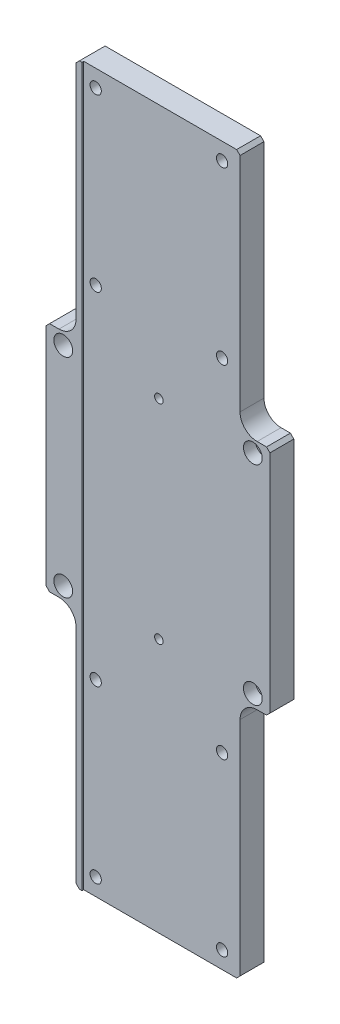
from build123d import *

# Parameters (mm, degrees)
SKETCH_1_W                   = 130
SKETCH_1_H                   = 136
SKETCH_1_W_2                 = 95
SKETCH_1_H_2                 = 420
EXTRUDE_1_DEPTH              = 7.5
SKETCH_2_W                   = 109
SKETCH_2_H                   = 420
CUT_EXTRUDE_1_DEPTH          = 1
HOLE_WIZARD_M6_1_D           = 6.6
HOLE_WIZARD_M6_1_CBORE_D     = 11
HOLE_WIZARD_M6_1_CBORE_DEPTH = 8
HOLE_WIZARD_M6_2_D           = 6.6
HOLE_WIZARD_M6_2_CBORE_D     = 11
HOLE_WIZARD_M6_2_CBORE_DEPTH = 8
PATTERN_LINEAR_1_COUNT       = 2
PATTERN_LINEAR_1_PITCH       = 300
F_5_0MM_1_D                  = 5
FILLET_1_R                   = 10
CHAMFER_1_SIZE               = 2


with BuildPart() as part:
    # Sketch 1 → Extrude 1 (new, symmetric)
    with BuildSketch(Plane.XY):
        Rectangle(SKETCH_1_W, SKETCH_1_H)
        Rectangle(SKETCH_1_W_2, SKETCH_1_H_2)
    extrude(amount=EXTRUDE_1_DEPTH, both=True)

    # Sketch 2 → Cut-Extrude 1 (cut)
    with BuildSketch(Plane.XY.offset(7.5)):
        with Locations((10.5, 0)):
            Rectangle(SKETCH_2_W, SKETCH_2_H)
    extrude(amount=-CUT_EXTRUDE_1_DEPTH, mode=Mode.SUBTRACT)

    # Hole Wizard M6 _ _ _ _ _1 (through all)
    with Locations(Plane.XY.offset(7.5)):
        with Locations((-55, 61), (-55, -61), (55, 61), (55, -61)):
            CounterBoreHole(HOLE_WIZARD_M6_1_D / 2, HOLE_WIZARD_M6_1_CBORE_D / 2, HOLE_WIZARD_M6_1_CBORE_DEPTH)

    # Hole Wizard M6 _ _ _ _ _2 (through all)
    with Locations(Plane(origin=(0, 0, -7.5), x_dir=(-1, 0, 0), z_dir=(0, 0, -1))):
        with Locations((-37, 200), (37, 200), (-37, 100), (37, 100)):
            hole_wizard_m6_2 = CounterBoreHole(HOLE_WIZARD_M6_2_D / 2, HOLE_WIZARD_M6_2_CBORE_D / 2, HOLE_WIZARD_M6_2_CBORE_DEPTH)

    # Pattern Linear 1: Hole Wizard M6 _ _ _ _ _2 ×2
    with Locations(*[(0, -i * PATTERN_LINEAR_1_PITCH, 0) for i in range(1, PATTERN_LINEAR_1_COUNT)]):
        add(hole_wizard_m6_2, mode=Mode.SUBTRACT)

    # 5.0mm _ _1 (through all)
    with Locations(Plane.XY.offset(6.5)):
        with Locations((0, -61), (0, 61)):
            Hole(F_5_0MM_1_D / 2)

    # Fillet 1
    fillet_1_edges = [part.edges().sort_by_distance(p)[0] for p in [
        (47.5, 68, -0.5),
        (47.5, -68, -0.5),
        (-47.5, 68, 0),
        (-47.5, -68, 0),
    ]]
    fillet(fillet_1_edges, radius=FILLET_1_R)

    # Chamfer 1
    chamfer_1_edges = [part.edges().sort_by_distance(p)[0] for p in [
        (-65, -68, 0),
        (-65, 68, 0),
        (65, 68, -0.5),
        (65, -68, -0.5),
        (47.5, -210, -0.5),
        (47.5, 210, -0.5),
        (-47.5, 210, 0),
        (-47.5, -210, 0),
    ]]
    chamfer(chamfer_1_edges, length=CHAMFER_1_SIZE)


solid = part.part
